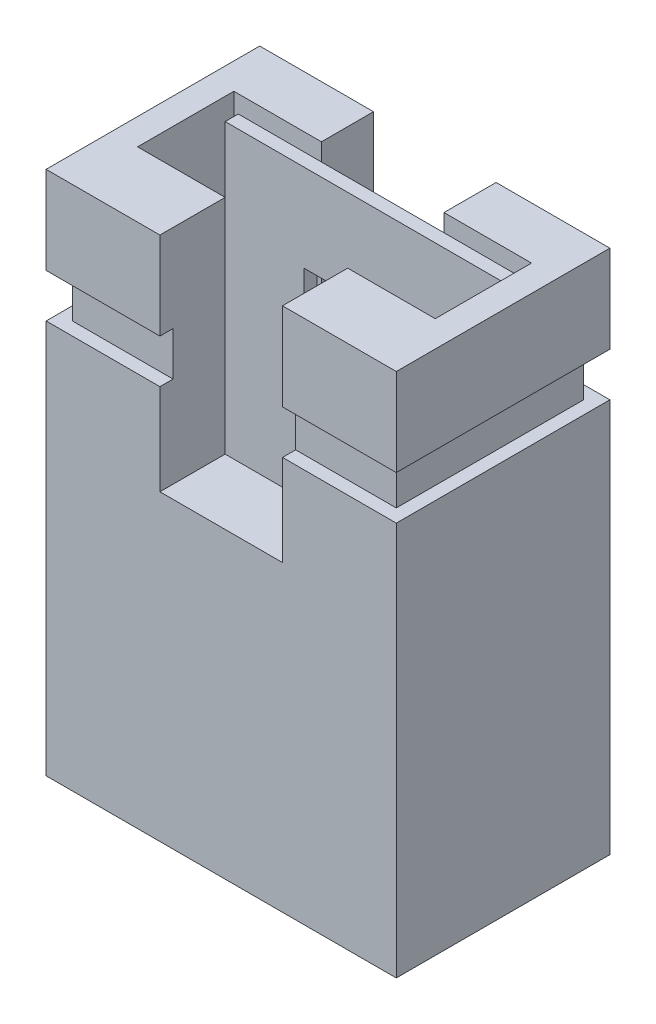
ISO-10303-21;
HEADER;
FILE_DESCRIPTION(('STEP AP214'),'2;1');
FILE_NAME('part.step','',(''),(''),'','','');
FILE_SCHEMA(('AUTOMOTIVE_DESIGN { 1 0 10303 214 1 1 1 1 }'));
ENDSEC;
DATA;
#1=APPLICATION_CONTEXT('core data for automotive mechanical design processes');
#2=APPLICATION_PROTOCOL_DEFINITION('international standard','automotive_design',2000,#1);
#3=PRODUCT_CONTEXT('',#1,'mechanical');
#4=PRODUCT('Part','Part','',(#3));
#5=PRODUCT_RELATED_PRODUCT_CATEGORY('part','',(#4));
#6=PRODUCT_DEFINITION_FORMATION('','',#4);
#7=PRODUCT_DEFINITION_CONTEXT('part definition',#1,'design');
#8=PRODUCT_DEFINITION('design','',#6,#7);
#9=PRODUCT_DEFINITION_SHAPE('','',#8);
#10=(LENGTH_UNIT() NAMED_UNIT(*) SI_UNIT(.MILLI.,.METRE.));
#11=(NAMED_UNIT(*) PLANE_ANGLE_UNIT() SI_UNIT($,.RADIAN.));
#12=(NAMED_UNIT(*) SI_UNIT($,.STERADIAN.) SOLID_ANGLE_UNIT());
#13=UNCERTAINTY_MEASURE_WITH_UNIT(LENGTH_MEASURE(1.E-05),#10,'distance_accuracy_value','');
#14=(GEOMETRIC_REPRESENTATION_CONTEXT(3) GLOBAL_UNCERTAINTY_ASSIGNED_CONTEXT((#13)) GLOBAL_UNIT_ASSIGNED_CONTEXT((#10,
#11,#12)) REPRESENTATION_CONTEXT('',''));
#15=CARTESIAN_POINT('',(0.,0.,0.));
#16=DIRECTION('',(0.,0.,1.));
#17=DIRECTION('',(1.,0.,0.));
#18=AXIS2_PLACEMENT_3D('',#15,#16,#17);
#19=CARTESIAN_POINT('',(-1.7,6.,-0.625));
#20=DIRECTION('',(0.,0.,1.));
#21=DIRECTION('',(1.,0.,0.));
#22=AXIS2_PLACEMENT_3D('',#19,#20,#21);
#23=PLANE('',#22);
#24=DIRECTION('',(0.,-1.,0.));
#25=VECTOR('',#24,1.);
#26=CARTESIAN_POINT('',(0.7,6.,-0.625));
#27=LINE('',#26,#25);
#28=CARTESIAN_POINT('',(0.7,6.,-0.625));
#29=VERTEX_POINT('',#28);
#30=CARTESIAN_POINT('',(0.7,5.8,-0.625));
#31=VERTEX_POINT('',#30);
#32=EDGE_CURVE('E415',#29,#31,#27,.T.);
#33=ORIENTED_EDGE('',*,*,#32,.T.);
#34=DIRECTION('',(-1.,0.,0.));
#35=VECTOR('',#34,1.);
#36=CARTESIAN_POINT('',(-1.65,5.8,-0.625));
#37=LINE('',#36,#35);
#38=CARTESIAN_POINT('',(1.65,5.8,-0.625));
#39=VERTEX_POINT('',#38);
#40=EDGE_CURVE('E45',#39,#31,#37,.T.);
#41=ORIENTED_EDGE('',*,*,#40,.F.);
#42=DIRECTION('',(0.,1.,0.));
#43=VECTOR('',#42,1.);
#44=CARTESIAN_POINT('',(1.65,0.4,-0.625));
#45=LINE('',#44,#43);
#46=CARTESIAN_POINT('',(1.65,0.4,-0.625));
#47=VERTEX_POINT('',#46);
#48=EDGE_CURVE('E49',#47,#39,#45,.T.);
#49=ORIENTED_EDGE('',*,*,#48,.F.);
#50=DIRECTION('',(1.,0.,0.));
#51=VECTOR('',#50,1.);
#52=CARTESIAN_POINT('',(-1.65,0.4,-0.625));
#53=LINE('',#52,#51);
#54=CARTESIAN_POINT('',(-1.65,0.399999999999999,-0.625));
#55=VERTEX_POINT('',#54);
#56=EDGE_CURVE('E317',#55,#47,#53,.T.);
#57=ORIENTED_EDGE('',*,*,#56,.F.);
#58=DIRECTION('',(0.,-1.,0.));
#59=VECTOR('',#58,1.);
#60=CARTESIAN_POINT('',(-1.65,0.4,-0.625));
#61=LINE('',#60,#59);
#62=CARTESIAN_POINT('',(-1.65,5.8,-0.625));
#63=VERTEX_POINT('',#62);
#64=EDGE_CURVE('E345',#63,#55,#61,.T.);
#65=ORIENTED_EDGE('',*,*,#64,.F.);
#66=DIRECTION('',(1.,0.,0.));
#67=VECTOR('',#66,1.);
#68=CARTESIAN_POINT('',(-1.7,5.8,-0.625));
#69=LINE('',#68,#67);
#70=CARTESIAN_POINT('',(-0.7,5.8,-0.625));
#71=VERTEX_POINT('',#70);
#72=EDGE_CURVE('E11',#63,#71,#69,.T.);
#73=ORIENTED_EDGE('',*,*,#72,.T.);
#74=DIRECTION('',(0.,1.,0.));
#75=VECTOR('',#74,1.);
#76=CARTESIAN_POINT('',(-0.7,6.,-0.625));
#77=LINE('',#76,#75);
#78=CARTESIAN_POINT('',(-0.7,6.,-0.625));
#79=VERTEX_POINT('',#78);
#80=EDGE_CURVE('E407',#71,#79,#77,.T.);
#81=ORIENTED_EDGE('',*,*,#80,.T.);
#82=DIRECTION('',(-1.,0.,0.));
#83=VECTOR('',#82,1.);
#84=CARTESIAN_POINT('',(-2.,6.,-0.625));
#85=LINE('',#84,#83);
#86=CARTESIAN_POINT('',(-1.7,6.,-0.625));
#87=VERTEX_POINT('',#86);
#88=EDGE_CURVE('E598',#79,#87,#85,.T.);
#89=ORIENTED_EDGE('',*,*,#88,.T.);
#90=DIRECTION('',(0.,-1.,0.));
#91=VECTOR('',#90,1.);
#92=CARTESIAN_POINT('',(-1.7,6.,-0.625));
#93=LINE('',#92,#91);
#94=CARTESIAN_POINT('',(-1.7,0.,-0.625));
#95=VERTEX_POINT('',#94);
#96=EDGE_CURVE('E396',#87,#95,#93,.T.);
#97=ORIENTED_EDGE('',*,*,#96,.T.);
#98=DIRECTION('',(-1.,0.,0.));
#99=VECTOR('',#98,1.);
#100=CARTESIAN_POINT('',(-1.7,0.,-0.625));
#101=LINE('',#100,#99);
#102=CARTESIAN_POINT('',(1.7,0.,-0.625));
#103=VERTEX_POINT('',#102);
#104=EDGE_CURVE('E384',#103,#95,#101,.T.);
#105=ORIENTED_EDGE('',*,*,#104,.F.);
#106=DIRECTION('',(0.,-1.,0.));
#107=VECTOR('',#106,1.);
#108=CARTESIAN_POINT('',(1.7,6.,-0.625));
#109=LINE('',#108,#107);
#110=CARTESIAN_POINT('',(1.7,6.,-0.625));
#111=VERTEX_POINT('',#110);
#112=EDGE_CURVE('E398',#111,#103,#109,.T.);
#113=ORIENTED_EDGE('',*,*,#112,.F.);
#114=DIRECTION('',(-1.,0.,0.));
#115=VECTOR('',#114,1.);
#116=CARTESIAN_POINT('',(-1.7,6.,-0.625));
#117=LINE('',#116,#115);
#118=EDGE_CURVE('E372',#111,#29,#117,.T.);
#119=ORIENTED_EDGE('',*,*,#118,.T.);
#120=EDGE_LOOP('',(#33,#41,#49,#57,#65,#73,#81,#89,#97,#105,#113,#119));
#121=FACE_BOUND('',#120,.T.);
#122=ADVANCED_FACE('F30',(#121),#23,.T.);
#123=CARTESIAN_POINT('',(-2.,0.,1.22));
#124=DIRECTION('',(0.,1.,0.));
#125=DIRECTION('',(0.,0.,1.));
#126=AXIS2_PLACEMENT_3D('',#123,#124,#125);
#127=PLANE('',#126);
#128=DIRECTION('',(1.,0.,0.));
#129=VECTOR('',#128,1.);
#130=CARTESIAN_POINT('',(-2.,0.,-1.22));
#131=LINE('',#130,#129);
#132=CARTESIAN_POINT('',(-2.,0.,-1.22));
#133=VERTEX_POINT('',#132);
#134=CARTESIAN_POINT('',(2.,0.,-1.22));
#135=VERTEX_POINT('',#134);
#136=EDGE_CURVE('E516',#133,#135,#131,.T.);
#137=ORIENTED_EDGE('',*,*,#136,.T.);
#138=DIRECTION('',(0.,0.,-1.));
#139=VECTOR('',#138,1.);
#140=CARTESIAN_POINT('',(2.,0.,1.22));
#141=LINE('',#140,#139);
#142=CARTESIAN_POINT('',(2.,0.,1.22));
#143=VERTEX_POINT('',#142);
#144=EDGE_CURVE('E592',#143,#135,#141,.T.);
#145=ORIENTED_EDGE('',*,*,#144,.F.);
#146=DIRECTION('',(1.,0.,0.));
#147=VECTOR('',#146,1.);
#148=CARTESIAN_POINT('',(-2.,0.,1.22));
#149=LINE('',#148,#147);
#150=CARTESIAN_POINT('',(-2.,0.,1.22));
#151=VERTEX_POINT('',#150);
#152=EDGE_CURVE('E482',#151,#143,#149,.T.);
#153=ORIENTED_EDGE('',*,*,#152,.F.);
#154=DIRECTION('',(0.,0.,-1.));
#155=VECTOR('',#154,1.);
#156=CARTESIAN_POINT('',(-2.,0.,1.22));
#157=LINE('',#156,#155);
#158=EDGE_CURVE('E595',#151,#133,#157,.T.);
#159=ORIENTED_EDGE('',*,*,#158,.T.);
#160=EDGE_LOOP('',(#137,#145,#153,#159));
#161=FACE_BOUND('',#160,.T.);
#162=DIRECTION('',(0.,0.,-1.));
#163=VECTOR('',#162,1.);
#164=CARTESIAN_POINT('',(1.7,0.,0.475));
#165=LINE('',#164,#163);
#166=CARTESIAN_POINT('',(1.7,0.,0.475));
#167=VERTEX_POINT('',#166);
#168=EDGE_CURVE('E369',#167,#103,#165,.T.);
#169=ORIENTED_EDGE('',*,*,#168,.T.);
#170=ORIENTED_EDGE('',*,*,#104,.T.);
#171=DIRECTION('',(0.,0.,1.));
#172=VECTOR('',#171,1.);
#173=CARTESIAN_POINT('',(-1.7,0.,0.475));
#174=LINE('',#173,#172);
#175=CARTESIAN_POINT('',(-1.7,0.,0.475));
#176=VERTEX_POINT('',#175);
#177=EDGE_CURVE('E387',#95,#176,#174,.T.);
#178=ORIENTED_EDGE('',*,*,#177,.T.);
#179=DIRECTION('',(1.,0.,0.));
#180=VECTOR('',#179,1.);
#181=CARTESIAN_POINT('',(-1.7,0.,0.475));
#182=LINE('',#181,#180);
#183=EDGE_CURVE('E373',#176,#167,#182,.T.);
#184=ORIENTED_EDGE('',*,*,#183,.T.);
#185=EDGE_LOOP('',(#169,#170,#178,#184));
#186=FACE_BOUND('',#185,.T.);
#187=ADVANCED_FACE('F693',(#161,#186),#127,.F.);
#188=CARTESIAN_POINT('',(0.7,6.,1.22));
#189=DIRECTION('',(0.,-1.,0.));
#190=DIRECTION('',(0.,0.,-1.));
#191=AXIS2_PLACEMENT_3D('',#188,#189,#190);
#192=PLANE('',#191);
#193=ORIENTED_EDGE('',*,*,#118,.F.);
#194=DIRECTION('',(0.,0.,-1.));
#195=VECTOR('',#194,1.);
#196=CARTESIAN_POINT('',(1.7,6.,0.475));
#197=LINE('',#196,#195);
#198=CARTESIAN_POINT('',(1.7,6.,0.475));
#199=VERTEX_POINT('',#198);
#200=EDGE_CURVE('E370',#199,#111,#197,.T.);
#201=ORIENTED_EDGE('',*,*,#200,.F.);
#202=DIRECTION('',(1.,0.,0.));
#203=VECTOR('',#202,1.);
#204=CARTESIAN_POINT('',(-1.7,6.,0.475));
#205=LINE('',#204,#203);
#206=CARTESIAN_POINT('',(0.7,6.,0.475));
#207=VERTEX_POINT('',#206);
#208=EDGE_CURVE('E378',#207,#199,#205,.T.);
#209=ORIENTED_EDGE('',*,*,#208,.F.);
#210=DIRECTION('',(0.,0.,-1.));
#211=VECTOR('',#210,1.);
#212=CARTESIAN_POINT('',(0.7,6.,1.22));
#213=LINE('',#212,#211);
#214=CARTESIAN_POINT('',(0.7,6.,1.22));
#215=VERTEX_POINT('',#214);
#216=EDGE_CURVE('E574',#215,#207,#213,.T.);
#217=ORIENTED_EDGE('',*,*,#216,.F.);
#218=DIRECTION('',(-1.,0.,0.));
#219=VECTOR('',#218,1.);
#220=CARTESIAN_POINT('',(0.7,6.,1.22));
#221=LINE('',#220,#219);
#222=CARTESIAN_POINT('',(2.,6.,1.22));
#223=VERTEX_POINT('',#222);
#224=EDGE_CURVE('E493',#223,#215,#221,.T.);
#225=ORIENTED_EDGE('',*,*,#224,.F.);
#226=DIRECTION('',(0.,0.,-1.));
#227=VECTOR('',#226,1.);
#228=CARTESIAN_POINT('',(2.,6.,1.22));
#229=LINE('',#228,#227);
#230=CARTESIAN_POINT('',(2.,6.,-1.22));
#231=VERTEX_POINT('',#230);
#232=EDGE_CURVE('E577',#223,#231,#229,.T.);
#233=ORIENTED_EDGE('',*,*,#232,.T.);
#234=DIRECTION('',(-1.,0.,0.));
#235=VECTOR('',#234,1.);
#236=CARTESIAN_POINT('',(0.7,6.,-1.22));
#237=LINE('',#236,#235);
#238=CARTESIAN_POINT('',(0.7,6.,-1.22));
#239=VERTEX_POINT('',#238);
#240=EDGE_CURVE('E526',#231,#239,#237,.T.);
#241=ORIENTED_EDGE('',*,*,#240,.T.);
#242=EDGE_CURVE('E573',#29,#239,#213,.T.);
#243=ORIENTED_EDGE('',*,*,#242,.F.);
#244=EDGE_LOOP('',(#193,#201,#209,#217,#225,#233,#241,#243));
#245=FACE_BOUND('',#244,.T.);
#246=ADVANCED_FACE('F685',(#245),#192,.F.);
#247=CARTESIAN_POINT('',(0.7,6.,1.22));
#248=DIRECTION('',(1.,0.,0.));
#249=DIRECTION('',(0.,1.,0.));
#250=AXIS2_PLACEMENT_3D('',#247,#248,#249);
#251=PLANE('',#250);
#252=ORIENTED_EDGE('',*,*,#32,.F.);
#253=ORIENTED_EDGE('',*,*,#242,.T.);
#254=DIRECTION('',(0.,-1.,0.));
#255=VECTOR('',#254,1.);
#256=CARTESIAN_POINT('',(0.7,6.,-1.22));
#257=LINE('',#256,#255);
#258=CARTESIAN_POINT('',(0.7,5.,-1.22));
#259=VERTEX_POINT('',#258);
#260=EDGE_CURVE('E530',#239,#259,#257,.T.);
#261=ORIENTED_EDGE('',*,*,#260,.T.);
#262=DIRECTION('',(0.,0.,1.));
#263=VECTOR('',#262,1.);
#264=CARTESIAN_POINT('',(0.7,5.00000000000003,1.22000000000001));
#265=LINE('',#264,#263);
#266=CARTESIAN_POINT('',(0.7,5.,-1.07));
#267=VERTEX_POINT('',#266);
#268=EDGE_CURVE('E430',#259,#267,#265,.T.);
#269=ORIENTED_EDGE('',*,*,#268,.T.);
#270=DIRECTION('',(0.,-1.,0.));
#271=VECTOR('',#270,1.);
#272=CARTESIAN_POINT('',(0.7,6.,-1.07));
#273=LINE('',#272,#271);
#274=CARTESIAN_POINT('',(0.7,4.5,-1.07));
#275=VERTEX_POINT('',#274);
#276=EDGE_CURVE('E445',#267,#275,#273,.T.);
#277=ORIENTED_EDGE('',*,*,#276,.T.);
#278=DIRECTION('',(0.,0.,-1.));
#279=VECTOR('',#278,1.);
#280=CARTESIAN_POINT('',(0.7,4.50000000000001,1.22000000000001));
#281=LINE('',#280,#279);
#282=CARTESIAN_POINT('',(0.7,4.5,-1.22));
#283=VERTEX_POINT('',#282);
#284=EDGE_CURVE('E436',#275,#283,#281,.T.);
#285=ORIENTED_EDGE('',*,*,#284,.T.);
#286=CARTESIAN_POINT('',(0.7,3.46,-1.22));
#287=VERTEX_POINT('',#286);
#288=EDGE_CURVE('E529',#283,#287,#257,.T.);
#289=ORIENTED_EDGE('',*,*,#288,.T.);
#290=DIRECTION('',(0.,0.,-1.));
#291=VECTOR('',#290,1.);
#292=CARTESIAN_POINT('',(0.7,3.46,1.22));
#293=LINE('',#292,#291);
#294=CARTESIAN_POINT('',(0.7,3.46,-0.625));
#295=VERTEX_POINT('',#294);
#296=EDGE_CURVE('E569',#295,#287,#293,.T.);
#297=ORIENTED_EDGE('',*,*,#296,.F.);
#298=CARTESIAN_POINT('',(0.7,4.8,-0.625));
#299=VERTEX_POINT('',#298);
#300=EDGE_CURVE('E414',#299,#295,#27,.T.);
#301=ORIENTED_EDGE('',*,*,#300,.F.);
#302=EDGE_CURVE('E418',#31,#299,#27,.T.);
#303=ORIENTED_EDGE('',*,*,#302,.F.);
#304=EDGE_LOOP('',(#252,#253,#261,#269,#277,#285,#289,#297,#301,#303));
#305=FACE_BOUND('',#304,.T.);
#306=ADVANCED_FACE('F623',(#305),#251,.F.);
#307=DIRECTION('',(0.,1.,0.));
#308=VECTOR('',#307,1.);
#309=CARTESIAN_POINT('',(0.7,6.,0.475));
#310=LINE('',#309,#308);
#311=CARTESIAN_POINT('',(0.7,3.46,0.475));
#312=VERTEX_POINT('',#311);
#313=EDGE_CURVE('E405',#312,#207,#310,.T.);
#314=ORIENTED_EDGE('',*,*,#313,.F.);
#315=CARTESIAN_POINT('',(0.7,3.46,1.22));
#316=VERTEX_POINT('',#315);
#317=EDGE_CURVE('E570',#316,#312,#293,.T.);
#318=ORIENTED_EDGE('',*,*,#317,.F.);
#319=DIRECTION('',(0.,-1.,0.));
#320=VECTOR('',#319,1.);
#321=CARTESIAN_POINT('',(0.7,6.,1.22));
#322=LINE('',#321,#320);
#323=CARTESIAN_POINT('',(0.7,4.5,1.22));
#324=VERTEX_POINT('',#323);
#325=EDGE_CURVE('E495',#324,#316,#322,.T.);
#326=ORIENTED_EDGE('',*,*,#325,.F.);
#327=DIRECTION('',(0.,0.,-1.));
#328=VECTOR('',#327,1.);
#329=CARTESIAN_POINT('',(0.7,4.5,1.22));
#330=LINE('',#329,#328);
#331=CARTESIAN_POINT('',(0.7,4.5,1.07));
#332=VERTEX_POINT('',#331);
#333=EDGE_CURVE('E460',#324,#332,#330,.T.);
#334=ORIENTED_EDGE('',*,*,#333,.T.);
#335=DIRECTION('',(0.,1.,0.));
#336=VECTOR('',#335,1.);
#337=CARTESIAN_POINT('',(0.7,6.,1.07));
#338=LINE('',#337,#336);
#339=CARTESIAN_POINT('',(0.7,5.,1.07));
#340=VERTEX_POINT('',#339);
#341=EDGE_CURVE('E475',#332,#340,#338,.T.);
#342=ORIENTED_EDGE('',*,*,#341,.T.);
#343=DIRECTION('',(0.,0.,1.));
#344=VECTOR('',#343,1.);
#345=CARTESIAN_POINT('',(0.7,5.,1.22));
#346=LINE('',#345,#344);
#347=CARTESIAN_POINT('',(0.7,5.,1.22));
#348=VERTEX_POINT('',#347);
#349=EDGE_CURVE('E466',#340,#348,#346,.T.);
#350=ORIENTED_EDGE('',*,*,#349,.T.);
#351=EDGE_CURVE('E496',#215,#348,#322,.T.);
#352=ORIENTED_EDGE('',*,*,#351,.F.);
#353=ORIENTED_EDGE('',*,*,#216,.T.);
#354=EDGE_LOOP('',(#314,#318,#326,#334,#342,#350,#352,#353));
#355=FACE_BOUND('',#354,.T.);
#356=ADVANCED_FACE('F677',(#355),#251,.F.);
#357=CARTESIAN_POINT('',(-0.7,3.46,1.22));
#358=DIRECTION('',(0.,-1.,0.));
#359=DIRECTION('',(0.,0.,-1.));
#360=AXIS2_PLACEMENT_3D('',#357,#358,#359);
#361=PLANE('',#360);
#362=DIRECTION('',(-1.,0.,0.));
#363=VECTOR('',#362,1.);
#364=CARTESIAN_POINT('',(-0.7,3.46,-0.625));
#365=LINE('',#364,#363);
#366=CARTESIAN_POINT('',(-0.7,3.46,-0.625));
#367=VERTEX_POINT('',#366);
#368=EDGE_CURVE('E411',#295,#367,#365,.T.);
#369=ORIENTED_EDGE('',*,*,#368,.F.);
#370=ORIENTED_EDGE('',*,*,#296,.T.);
#371=DIRECTION('',(-1.,0.,0.));
#372=VECTOR('',#371,1.);
#373=CARTESIAN_POINT('',(-0.7,3.46,-1.22));
#374=LINE('',#373,#372);
#375=CARTESIAN_POINT('',(-0.7,3.46,-1.22));
#376=VERTEX_POINT('',#375);
#377=EDGE_CURVE('E533',#287,#376,#374,.T.);
#378=ORIENTED_EDGE('',*,*,#377,.T.);
#379=DIRECTION('',(0.,0.,-1.));
#380=VECTOR('',#379,1.);
#381=CARTESIAN_POINT('',(-0.7,3.46,1.22));
#382=LINE('',#381,#380);
#383=EDGE_CURVE('E565',#367,#376,#382,.T.);
#384=ORIENTED_EDGE('',*,*,#383,.F.);
#385=EDGE_LOOP('',(#369,#370,#378,#384));
#386=FACE_BOUND('',#385,.T.);
#387=ADVANCED_FACE('F621',(#386),#361,.F.);
#388=DIRECTION('',(1.,0.,0.));
#389=VECTOR('',#388,1.);
#390=CARTESIAN_POINT('',(-0.7,3.46,0.475));
#391=LINE('',#390,#389);
#392=CARTESIAN_POINT('',(-0.7,3.46,0.475));
#393=VERTEX_POINT('',#392);
#394=EDGE_CURVE('E403',#393,#312,#391,.T.);
#395=ORIENTED_EDGE('',*,*,#394,.F.);
#396=CARTESIAN_POINT('',(-0.7,3.46,1.22));
#397=VERTEX_POINT('',#396);
#398=EDGE_CURVE('E566',#397,#393,#382,.T.);
#399=ORIENTED_EDGE('',*,*,#398,.F.);
#400=DIRECTION('',(-1.,0.,0.));
#401=VECTOR('',#400,1.);
#402=CARTESIAN_POINT('',(-0.7,3.46,1.22));
#403=LINE('',#402,#401);
#404=EDGE_CURVE('E499',#316,#397,#403,.T.);
#405=ORIENTED_EDGE('',*,*,#404,.F.);
#406=ORIENTED_EDGE('',*,*,#317,.T.);
#407=EDGE_LOOP('',(#395,#399,#405,#406));
#408=FACE_BOUND('',#407,.T.);
#409=ADVANCED_FACE('F672',(#408),#361,.F.);
#410=CARTESIAN_POINT('',(-0.7,6.,1.22));
#411=DIRECTION('',(-1.,0.,0.));
#412=DIRECTION('',(0.,-1.,0.));
#413=AXIS2_PLACEMENT_3D('',#410,#411,#412);
#414=PLANE('',#413);
#415=CARTESIAN_POINT('',(-0.7,4.8,-0.625));
#416=VERTEX_POINT('',#415);
#417=EDGE_CURVE('E408',#367,#416,#77,.T.);
#418=ORIENTED_EDGE('',*,*,#417,.F.);
#419=ORIENTED_EDGE('',*,*,#383,.T.);
#420=DIRECTION('',(0.,1.,0.));
#421=VECTOR('',#420,1.);
#422=CARTESIAN_POINT('',(-0.7,6.,-1.22));
#423=LINE('',#422,#421);
#424=CARTESIAN_POINT('',(-0.7,4.5,-1.22));
#425=VERTEX_POINT('',#424);
#426=EDGE_CURVE('E537',#376,#425,#423,.T.);
#427=ORIENTED_EDGE('',*,*,#426,.T.);
#428=DIRECTION('',(0.,0.,1.));
#429=VECTOR('',#428,1.);
#430=CARTESIAN_POINT('',(-0.7,4.50000000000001,1.22000000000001));
#431=LINE('',#430,#429);
#432=CARTESIAN_POINT('',(-0.7,4.5,-1.07));
#433=VERTEX_POINT('',#432);
#434=EDGE_CURVE('E433',#425,#433,#431,.T.);
#435=ORIENTED_EDGE('',*,*,#434,.T.);
#436=DIRECTION('',(0.,1.,0.));
#437=VECTOR('',#436,1.);
#438=CARTESIAN_POINT('',(-0.7,6.,-1.07));
#439=LINE('',#438,#437);
#440=CARTESIAN_POINT('',(-0.7,5.,-1.07));
#441=VERTEX_POINT('',#440);
#442=EDGE_CURVE('E442',#433,#441,#439,.T.);
#443=ORIENTED_EDGE('',*,*,#442,.T.);
#444=DIRECTION('',(0.,0.,-1.));
#445=VECTOR('',#444,1.);
#446=CARTESIAN_POINT('',(-0.7,5.00000000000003,1.22000000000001));
#447=LINE('',#446,#445);
#448=CARTESIAN_POINT('',(-0.7,5.,-1.22));
#449=VERTEX_POINT('',#448);
#450=EDGE_CURVE('E427',#441,#449,#447,.T.);
#451=ORIENTED_EDGE('',*,*,#450,.T.);
#452=CARTESIAN_POINT('',(-0.7,6.,-1.22));
#453=VERTEX_POINT('',#452);
#454=EDGE_CURVE('E536',#449,#453,#423,.T.);
#455=ORIENTED_EDGE('',*,*,#454,.T.);
#456=DIRECTION('',(0.,0.,-1.));
#457=VECTOR('',#456,1.);
#458=CARTESIAN_POINT('',(-0.7,6.,1.22));
#459=LINE('',#458,#457);
#460=EDGE_CURVE('E561',#79,#453,#459,.T.);
#461=ORIENTED_EDGE('',*,*,#460,.F.);
#462=ORIENTED_EDGE('',*,*,#80,.F.);
#463=EDGE_CURVE('E412',#416,#71,#77,.T.);
#464=ORIENTED_EDGE('',*,*,#463,.F.);
#465=EDGE_LOOP('',(#418,#419,#427,#435,#443,#451,#455,#461,#462,#464));
#466=FACE_BOUND('',#465,.T.);
#467=ADVANCED_FACE('F633',(#466),#414,.F.);
#468=DIRECTION('',(0.,-1.,0.));
#469=VECTOR('',#468,1.);
#470=CARTESIAN_POINT('',(-0.7,6.,0.475));
#471=LINE('',#470,#469);
#472=CARTESIAN_POINT('',(-0.7,6.,0.475));
#473=VERTEX_POINT('',#472);
#474=EDGE_CURVE('E401',#473,#393,#471,.T.);
#475=ORIENTED_EDGE('',*,*,#474,.F.);
#476=CARTESIAN_POINT('',(-0.7,6.,1.22));
#477=VERTEX_POINT('',#476);
#478=EDGE_CURVE('E562',#477,#473,#459,.T.);
#479=ORIENTED_EDGE('',*,*,#478,.F.);
#480=DIRECTION('',(0.,1.,0.));
#481=VECTOR('',#480,1.);
#482=CARTESIAN_POINT('',(-0.7,6.,1.22));
#483=LINE('',#482,#481);
#484=CARTESIAN_POINT('',(-0.7,5.,1.22));
#485=VERTEX_POINT('',#484);
#486=EDGE_CURVE('E501',#485,#477,#483,.T.);
#487=ORIENTED_EDGE('',*,*,#486,.F.);
#488=DIRECTION('',(0.,0.,-1.));
#489=VECTOR('',#488,1.);
#490=CARTESIAN_POINT('',(-0.7,5.,1.22));
#491=LINE('',#490,#489);
#492=CARTESIAN_POINT('',(-0.7,5.,1.07));
#493=VERTEX_POINT('',#492);
#494=EDGE_CURVE('E463',#485,#493,#491,.T.);
#495=ORIENTED_EDGE('',*,*,#494,.T.);
#496=DIRECTION('',(0.,-1.,0.));
#497=VECTOR('',#496,1.);
#498=CARTESIAN_POINT('',(-0.7,6.,1.07));
#499=LINE('',#498,#497);
#500=CARTESIAN_POINT('',(-0.7,4.5,1.07));
#501=VERTEX_POINT('',#500);
#502=EDGE_CURVE('E472',#493,#501,#499,.T.);
#503=ORIENTED_EDGE('',*,*,#502,.T.);
#504=DIRECTION('',(0.,0.,1.));
#505=VECTOR('',#504,1.);
#506=CARTESIAN_POINT('',(-0.7,4.5,1.22));
#507=LINE('',#506,#505);
#508=CARTESIAN_POINT('',(-0.7,4.5,1.22));
#509=VERTEX_POINT('',#508);
#510=EDGE_CURVE('E457',#501,#509,#507,.T.);
#511=ORIENTED_EDGE('',*,*,#510,.T.);
#512=EDGE_CURVE('E502',#397,#509,#483,.T.);
#513=ORIENTED_EDGE('',*,*,#512,.F.);
#514=ORIENTED_EDGE('',*,*,#398,.T.);
#515=EDGE_LOOP('',(#475,#479,#487,#495,#503,#511,#513,#514));
#516=FACE_BOUND('',#515,.T.);
#517=ADVANCED_FACE('F664',(#516),#414,.F.);
#518=CARTESIAN_POINT('',(-2.,6.,1.22));
#519=DIRECTION('',(0.,-1.,0.));
#520=DIRECTION('',(0.,0.,-1.));
#521=AXIS2_PLACEMENT_3D('',#518,#519,#520);
#522=PLANE('',#521);
#523=ORIENTED_EDGE('',*,*,#88,.F.);
#524=ORIENTED_EDGE('',*,*,#460,.T.);
#525=DIRECTION('',(-1.,0.,0.));
#526=VECTOR('',#525,1.);
#527=CARTESIAN_POINT('',(-2.,6.,-1.22));
#528=LINE('',#527,#526);
#529=CARTESIAN_POINT('',(-2.,6.,-1.22));
#530=VERTEX_POINT('',#529);
#531=EDGE_CURVE('E540',#453,#530,#528,.T.);
#532=ORIENTED_EDGE('',*,*,#531,.T.);
#533=DIRECTION('',(0.,0.,-1.));
#534=VECTOR('',#533,1.);
#535=CARTESIAN_POINT('',(-2.,6.,1.22));
#536=LINE('',#535,#534);
#537=CARTESIAN_POINT('',(-2.,6.,1.22));
#538=VERTEX_POINT('',#537);
#539=EDGE_CURVE('E558',#538,#530,#536,.T.);
#540=ORIENTED_EDGE('',*,*,#539,.F.);
#541=DIRECTION('',(-1.,0.,0.));
#542=VECTOR('',#541,1.);
#543=CARTESIAN_POINT('',(-2.,6.,1.22));
#544=LINE('',#543,#542);
#545=EDGE_CURVE('E505',#477,#538,#544,.T.);
#546=ORIENTED_EDGE('',*,*,#545,.F.);
#547=ORIENTED_EDGE('',*,*,#478,.T.);
#548=CARTESIAN_POINT('',(-1.7,6.,0.475));
#549=VERTEX_POINT('',#548);
#550=EDGE_CURVE('E379',#549,#473,#205,.T.);
#551=ORIENTED_EDGE('',*,*,#550,.F.);
#552=DIRECTION('',(0.,0.,1.));
#553=VECTOR('',#552,1.);
#554=CARTESIAN_POINT('',(-1.7,6.,0.475));
#555=LINE('',#554,#553);
#556=EDGE_CURVE('E375',#87,#549,#555,.T.);
#557=ORIENTED_EDGE('',*,*,#556,.F.);
#558=EDGE_LOOP('',(#523,#524,#532,#540,#546,#547,#551,#557));
#559=FACE_BOUND('',#558,.T.);
#560=ADVANCED_FACE('F641',(#559),#522,.F.);
#561=CARTESIAN_POINT('',(-2.,4.5,-1.22));
#562=DIRECTION('',(0.,0.,-1.));
#563=DIRECTION('',(-1.,0.,0.));
#564=AXIS2_PLACEMENT_3D('',#561,#562,#563);
#565=PLANE('',#564);
#566=ORIENTED_EDGE('',*,*,#288,.F.);
#567=DIRECTION('',(-1.,0.,0.));
#568=VECTOR('',#567,1.);
#569=CARTESIAN_POINT('',(2.,4.5,-1.22));
#570=LINE('',#569,#568);
#571=CARTESIAN_POINT('',(2.,4.5,-1.22));
#572=VERTEX_POINT('',#571);
#573=EDGE_CURVE('E520',#572,#283,#570,.T.);
#574=ORIENTED_EDGE('',*,*,#573,.F.);
#575=DIRECTION('',(0.,1.,0.));
#576=VECTOR('',#575,1.);
#577=CARTESIAN_POINT('',(2.,0.,-1.22));
#578=LINE('',#577,#576);
#579=EDGE_CURVE('E518',#135,#572,#578,.T.);
#580=ORIENTED_EDGE('',*,*,#579,.F.);
#581=ORIENTED_EDGE('',*,*,#136,.F.);
#582=DIRECTION('',(0.,-1.,0.));
#583=VECTOR('',#582,1.);
#584=CARTESIAN_POINT('',(-2.,0.,-1.22));
#585=LINE('',#584,#583);
#586=CARTESIAN_POINT('',(-2.,4.5,-1.22));
#587=VERTEX_POINT('',#586);
#588=EDGE_CURVE('E478',#587,#133,#585,.T.);
#589=ORIENTED_EDGE('',*,*,#588,.F.);
#590=DIRECTION('',(-1.,0.,0.));
#591=VECTOR('',#590,1.);
#592=CARTESIAN_POINT('',(-2.,4.5,-1.22));
#593=LINE('',#592,#591);
#594=EDGE_CURVE('E483',#425,#587,#593,.T.);
#595=ORIENTED_EDGE('',*,*,#594,.F.);
#596=ORIENTED_EDGE('',*,*,#426,.F.);
#597=ORIENTED_EDGE('',*,*,#377,.F.);
#598=EDGE_LOOP('',(#566,#574,#580,#581,#589,#595,#596,#597));
#599=FACE_BOUND('',#598,.T.);
#600=ADVANCED_FACE('F629',(#599),#565,.T.);
#601=ORIENTED_EDGE('',*,*,#454,.F.);
#602=DIRECTION('',(1.,0.,0.));
#603=VECTOR('',#602,1.);
#604=CARTESIAN_POINT('',(-2.,5.,-1.22));
#605=LINE('',#604,#603);
#606=CARTESIAN_POINT('',(-2.,5.,-1.22));
#607=VERTEX_POINT('',#606);
#608=EDGE_CURVE('E545',#607,#449,#605,.T.);
#609=ORIENTED_EDGE('',*,*,#608,.F.);
#610=DIRECTION('',(0.,-1.,0.));
#611=VECTOR('',#610,1.);
#612=CARTESIAN_POINT('',(-2.,5.,-1.22));
#613=LINE('',#612,#611);
#614=EDGE_CURVE('E542',#530,#607,#613,.T.);
#615=ORIENTED_EDGE('',*,*,#614,.F.);
#616=ORIENTED_EDGE('',*,*,#531,.F.);
#617=EDGE_LOOP('',(#601,#609,#615,#616));
#618=FACE_BOUND('',#617,.T.);
#619=ADVANCED_FACE('F649',(#618),#565,.T.);
#620=CARTESIAN_POINT('',(-2.,4.5,1.22));
#621=DIRECTION('',(0.,0.,-1.));
#622=DIRECTION('',(-1.,0.,0.));
#623=AXIS2_PLACEMENT_3D('',#620,#621,#622);
#624=PLANE('',#623);
#625=ORIENTED_EDGE('',*,*,#351,.T.);
#626=DIRECTION('',(1.,0.,0.));
#627=VECTOR('',#626,1.);
#628=CARTESIAN_POINT('',(2.,5.,1.22));
#629=LINE('',#628,#627);
#630=CARTESIAN_POINT('',(2.,5.,1.22));
#631=VERTEX_POINT('',#630);
#632=EDGE_CURVE('E489',#348,#631,#629,.T.);
#633=ORIENTED_EDGE('',*,*,#632,.T.);
#634=DIRECTION('',(0.,1.,0.));
#635=VECTOR('',#634,1.);
#636=CARTESIAN_POINT('',(2.,5.,1.22));
#637=LINE('',#636,#635);
#638=EDGE_CURVE('E491',#631,#223,#637,.T.);
#639=ORIENTED_EDGE('',*,*,#638,.T.);
#640=ORIENTED_EDGE('',*,*,#224,.T.);
#641=EDGE_LOOP('',(#625,#633,#639,#640));
#642=FACE_BOUND('',#641,.T.);
#643=ADVANCED_FACE('F737',(#642),#624,.F.);
#644=DIRECTION('',(1.,0.,0.));
#645=VECTOR('',#644,1.);
#646=CARTESIAN_POINT('',(-2.,5.,1.22));
#647=LINE('',#646,#645);
#648=CARTESIAN_POINT('',(-2.,5.,1.22));
#649=VERTEX_POINT('',#648);
#650=EDGE_CURVE('E509',#649,#485,#647,.T.);
#651=ORIENTED_EDGE('',*,*,#650,.T.);
#652=ORIENTED_EDGE('',*,*,#486,.T.);
#653=ORIENTED_EDGE('',*,*,#545,.T.);
#654=DIRECTION('',(0.,-1.,0.));
#655=VECTOR('',#654,1.);
#656=CARTESIAN_POINT('',(-2.,5.,1.22));
#657=LINE('',#656,#655);
#658=EDGE_CURVE('E507',#538,#649,#657,.T.);
#659=ORIENTED_EDGE('',*,*,#658,.T.);
#660=EDGE_LOOP('',(#651,#652,#653,#659));
#661=FACE_BOUND('',#660,.T.);
#662=ADVANCED_FACE('F658',(#661),#624,.F.);
#663=CARTESIAN_POINT('',(-2.,0.,1.22));
#664=DIRECTION('',(1.,0.,0.));
#665=DIRECTION('',(0.,0.,-1.));
#666=AXIS2_PLACEMENT_3D('',#663,#664,#665);
#667=PLANE('',#666);
#668=ORIENTED_EDGE('',*,*,#588,.T.);
#669=ORIENTED_EDGE('',*,*,#158,.F.);
#670=DIRECTION('',(0.,-1.,0.));
#671=VECTOR('',#670,1.);
#672=CARTESIAN_POINT('',(-2.,0.,1.22));
#673=LINE('',#672,#671);
#674=CARTESIAN_POINT('',(-2.,4.5,1.22));
#675=VERTEX_POINT('',#674);
#676=EDGE_CURVE('E479',#675,#151,#673,.T.);
#677=ORIENTED_EDGE('',*,*,#676,.F.);
#678=DIRECTION('',(0.,0.,-1.));
#679=VECTOR('',#678,1.);
#680=CARTESIAN_POINT('',(-2.,4.5,1.22));
#681=LINE('',#680,#679);
#682=EDGE_CURVE('E513',#675,#587,#681,.T.);
#683=ORIENTED_EDGE('',*,*,#682,.T.);
#684=EDGE_LOOP('',(#668,#669,#677,#683));
#685=FACE_BOUND('',#684,.T.);
#686=ADVANCED_FACE('F32',(#685),#667,.F.);
#687=CARTESIAN_POINT('',(2.,0.,1.22));
#688=DIRECTION('',(-1.,0.,0.));
#689=DIRECTION('',(0.,0.,1.));
#690=AXIS2_PLACEMENT_3D('',#687,#688,#689);
#691=PLANE('',#690);
#692=ORIENTED_EDGE('',*,*,#579,.T.);
#693=DIRECTION('',(0.,0.,-1.));
#694=VECTOR('',#693,1.);
#695=CARTESIAN_POINT('',(2.,4.5,1.22));
#696=LINE('',#695,#694);
#697=CARTESIAN_POINT('',(2.,4.5,1.22));
#698=VERTEX_POINT('',#697);
#699=EDGE_CURVE('E589',#698,#572,#696,.T.);
#700=ORIENTED_EDGE('',*,*,#699,.F.);
#701=DIRECTION('',(0.,1.,0.));
#702=VECTOR('',#701,1.);
#703=CARTESIAN_POINT('',(2.,0.,1.22));
#704=LINE('',#703,#702);
#705=EDGE_CURVE('E485',#143,#698,#704,.T.);
#706=ORIENTED_EDGE('',*,*,#705,.F.);
#707=ORIENTED_EDGE('',*,*,#144,.T.);
#708=EDGE_LOOP('',(#692,#700,#706,#707));
#709=FACE_BOUND('',#708,.T.);
#710=ADVANCED_FACE('F779',(#709),#691,.F.);
#711=CARTESIAN_POINT('',(2.,4.5,1.22));
#712=DIRECTION('',(0.,-1.,0.));
#713=DIRECTION('',(0.,0.,-1.));
#714=AXIS2_PLACEMENT_3D('',#711,#712,#713);
#715=PLANE('',#714);
#716=ORIENTED_EDGE('',*,*,#573,.T.);
#717=ORIENTED_EDGE('',*,*,#284,.F.);
#718=DIRECTION('',(1.,0.,0.));
#719=VECTOR('',#718,1.);
#720=CARTESIAN_POINT('',(-2.,4.5,-1.07));
#721=LINE('',#720,#719);
#722=CARTESIAN_POINT('',(1.85,4.5,-1.07));
#723=VERTEX_POINT('',#722);
#724=EDGE_CURVE('E422',#275,#723,#721,.T.);
#725=ORIENTED_EDGE('',*,*,#724,.T.);
#726=DIRECTION('',(0.,0.,-1.));
#727=VECTOR('',#726,1.);
#728=CARTESIAN_POINT('',(1.85,4.5,1.22));
#729=LINE('',#728,#727);
#730=CARTESIAN_POINT('',(1.85,4.5,1.07));
#731=VERTEX_POINT('',#730);
#732=EDGE_CURVE('E586',#731,#723,#729,.T.);
#733=ORIENTED_EDGE('',*,*,#732,.F.);
#734=DIRECTION('',(1.,0.,0.));
#735=VECTOR('',#734,1.);
#736=CARTESIAN_POINT('',(-2.,4.5,1.07));
#737=LINE('',#736,#735);
#738=EDGE_CURVE('E451',#332,#731,#737,.T.);
#739=ORIENTED_EDGE('',*,*,#738,.F.);
#740=ORIENTED_EDGE('',*,*,#333,.F.);
#741=DIRECTION('',(-1.,0.,0.));
#742=VECTOR('',#741,1.);
#743=CARTESIAN_POINT('',(2.,4.5,1.22));
#744=LINE('',#743,#742);
#745=EDGE_CURVE('E487',#698,#324,#744,.T.);
#746=ORIENTED_EDGE('',*,*,#745,.F.);
#747=ORIENTED_EDGE('',*,*,#699,.T.);
#748=EDGE_LOOP('',(#716,#717,#725,#733,#739,#740,#746,#747));
#749=FACE_BOUND('',#748,.T.);
#750=ADVANCED_FACE('F775',(#749),#715,.F.);
#751=CARTESIAN_POINT('',(1.85,5.,1.22));
#752=DIRECTION('',(-1.,0.,0.));
#753=DIRECTION('',(0.,0.,1.));
#754=AXIS2_PLACEMENT_3D('',#751,#752,#753);
#755=PLANE('',#754);
#756=ORIENTED_EDGE('',*,*,#732,.T.);
#757=DIRECTION('',(0.,-1.,0.));
#758=VECTOR('',#757,1.);
#759=CARTESIAN_POINT('',(1.85,4.5,-1.07));
#760=LINE('',#759,#758);
#761=CARTESIAN_POINT('',(1.85,5.,-1.07));
#762=VERTEX_POINT('',#761);
#763=EDGE_CURVE('E417',#762,#723,#760,.T.);
#764=ORIENTED_EDGE('',*,*,#763,.F.);
#765=DIRECTION('',(0.,0.,-1.));
#766=VECTOR('',#765,1.);
#767=CARTESIAN_POINT('',(1.85,5.,1.22));
#768=LINE('',#767,#766);
#769=CARTESIAN_POINT('',(1.85,5.,1.07));
#770=VERTEX_POINT('',#769);
#771=EDGE_CURVE('E583',#770,#762,#768,.T.);
#772=ORIENTED_EDGE('',*,*,#771,.F.);
#773=DIRECTION('',(0.,1.,0.));
#774=VECTOR('',#773,1.);
#775=CARTESIAN_POINT('',(1.85,4.5,1.07));
#776=LINE('',#775,#774);
#777=EDGE_CURVE('E448',#731,#770,#776,.T.);
#778=ORIENTED_EDGE('',*,*,#777,.F.);
#779=EDGE_LOOP('',(#756,#764,#772,#778));
#780=FACE_BOUND('',#779,.T.);
#781=ADVANCED_FACE('F771',(#780),#755,.F.);
#782=CARTESIAN_POINT('',(2.,5.,1.22));
#783=DIRECTION('',(0.,1.,0.));
#784=DIRECTION('',(0.,0.,1.));
#785=AXIS2_PLACEMENT_3D('',#782,#783,#784);
#786=PLANE('',#785);
#787=DIRECTION('',(1.,0.,0.));
#788=VECTOR('',#787,1.);
#789=CARTESIAN_POINT('',(2.,5.,-1.22));
#790=LINE('',#789,#788);
#791=CARTESIAN_POINT('',(2.,5.,-1.22));
#792=VERTEX_POINT('',#791);
#793=EDGE_CURVE('E522',#259,#792,#790,.T.);
#794=ORIENTED_EDGE('',*,*,#793,.T.);
#795=DIRECTION('',(0.,0.,-1.));
#796=VECTOR('',#795,1.);
#797=CARTESIAN_POINT('',(2.,5.,1.22));
#798=LINE('',#797,#796);
#799=EDGE_CURVE('E580',#631,#792,#798,.T.);
#800=ORIENTED_EDGE('',*,*,#799,.F.);
#801=ORIENTED_EDGE('',*,*,#632,.F.);
#802=ORIENTED_EDGE('',*,*,#349,.F.);
#803=DIRECTION('',(1.,0.,0.));
#804=VECTOR('',#803,1.);
#805=CARTESIAN_POINT('',(-2.,5.,1.07));
#806=LINE('',#805,#804);
#807=EDGE_CURVE('E452',#340,#770,#806,.T.);
#808=ORIENTED_EDGE('',*,*,#807,.T.);
#809=ORIENTED_EDGE('',*,*,#771,.T.);
#810=DIRECTION('',(1.,0.,0.));
#811=VECTOR('',#810,1.);
#812=CARTESIAN_POINT('',(-2.,5.,-1.07));
#813=LINE('',#812,#811);
#814=EDGE_CURVE('E421',#267,#762,#813,.T.);
#815=ORIENTED_EDGE('',*,*,#814,.F.);
#816=ORIENTED_EDGE('',*,*,#268,.F.);
#817=EDGE_LOOP('',(#794,#800,#801,#802,#808,#809,#815,#816));
#818=FACE_BOUND('',#817,.T.);
#819=ADVANCED_FACE('F767',(#818),#786,.F.);
#820=CARTESIAN_POINT('',(2.,5.,1.22));
#821=DIRECTION('',(-1.,0.,0.));
#822=DIRECTION('',(0.,0.,1.));
#823=AXIS2_PLACEMENT_3D('',#820,#821,#822);
#824=PLANE('',#823);
#825=DIRECTION('',(0.,1.,0.));
#826=VECTOR('',#825,1.);
#827=CARTESIAN_POINT('',(2.,5.,-1.22));
#828=LINE('',#827,#826);
#829=EDGE_CURVE('E524',#792,#231,#828,.T.);
#830=ORIENTED_EDGE('',*,*,#829,.T.);
#831=ORIENTED_EDGE('',*,*,#232,.F.);
#832=ORIENTED_EDGE('',*,*,#638,.F.);
#833=ORIENTED_EDGE('',*,*,#799,.T.);
#834=EDGE_LOOP('',(#830,#831,#832,#833));
#835=FACE_BOUND('',#834,.T.);
#836=ADVANCED_FACE('F754',(#835),#824,.F.);
#837=CARTESIAN_POINT('',(-2.,5.,1.22));
#838=DIRECTION('',(1.,0.,0.));
#839=DIRECTION('',(0.,0.,-1.));
#840=AXIS2_PLACEMENT_3D('',#837,#838,#839);
#841=PLANE('',#840);
#842=ORIENTED_EDGE('',*,*,#614,.T.);
#843=DIRECTION('',(0.,0.,-1.));
#844=VECTOR('',#843,1.);
#845=CARTESIAN_POINT('',(-2.,5.,1.22));
#846=LINE('',#845,#844);
#847=EDGE_CURVE('E556',#649,#607,#846,.T.);
#848=ORIENTED_EDGE('',*,*,#847,.F.);
#849=ORIENTED_EDGE('',*,*,#658,.F.);
#850=ORIENTED_EDGE('',*,*,#539,.T.);
#851=EDGE_LOOP('',(#842,#848,#849,#850));
#852=FACE_BOUND('',#851,.T.);
#853=ADVANCED_FACE('F654',(#852),#841,.F.);
#854=CARTESIAN_POINT('',(-2.,5.,1.22));
#855=DIRECTION('',(0.,1.,0.));
#856=DIRECTION('',(0.,0.,1.));
#857=AXIS2_PLACEMENT_3D('',#854,#855,#856);
#858=PLANE('',#857);
#859=ORIENTED_EDGE('',*,*,#847,.T.);
#860=ORIENTED_EDGE('',*,*,#608,.T.);
#861=ORIENTED_EDGE('',*,*,#450,.F.);
#862=CARTESIAN_POINT('',(-1.85,5.,-1.07));
#863=VERTEX_POINT('',#862);
#864=EDGE_CURVE('E425',#863,#441,#813,.T.);
#865=ORIENTED_EDGE('',*,*,#864,.F.);
#866=DIRECTION('',(0.,0.,-1.));
#867=VECTOR('',#866,1.);
#868=CARTESIAN_POINT('',(-1.85,5.,1.22));
#869=LINE('',#868,#867);
#870=CARTESIAN_POINT('',(-1.85,5.,1.07));
#871=VERTEX_POINT('',#870);
#872=EDGE_CURVE('E553',#871,#863,#869,.T.);
#873=ORIENTED_EDGE('',*,*,#872,.F.);
#874=EDGE_CURVE('E454',#871,#493,#806,.T.);
#875=ORIENTED_EDGE('',*,*,#874,.T.);
#876=ORIENTED_EDGE('',*,*,#494,.F.);
#877=ORIENTED_EDGE('',*,*,#650,.F.);
#878=EDGE_LOOP('',(#859,#860,#861,#865,#873,#875,#876,#877));
#879=FACE_BOUND('',#878,.T.);
#880=ADVANCED_FACE('F747',(#879),#858,.F.);
#881=CARTESIAN_POINT('',(-1.85,5.,1.22));
#882=DIRECTION('',(1.,0.,0.));
#883=DIRECTION('',(0.,0.,-1.));
#884=AXIS2_PLACEMENT_3D('',#881,#882,#883);
#885=PLANE('',#884);
#886=ORIENTED_EDGE('',*,*,#872,.T.);
#887=DIRECTION('',(0.,-1.,0.));
#888=VECTOR('',#887,1.);
#889=CARTESIAN_POINT('',(-1.85,5.,-1.07));
#890=LINE('',#889,#888);
#891=CARTESIAN_POINT('',(-1.85,4.5,-1.07));
#892=VERTEX_POINT('',#891);
#893=EDGE_CURVE('E439',#863,#892,#890,.T.);
#894=ORIENTED_EDGE('',*,*,#893,.T.);
#895=DIRECTION('',(0.,0.,-1.));
#896=VECTOR('',#895,1.);
#897=CARTESIAN_POINT('',(-1.85,4.5,1.22));
#898=LINE('',#897,#896);
#899=CARTESIAN_POINT('',(-1.85,4.5,1.07));
#900=VERTEX_POINT('',#899);
#901=EDGE_CURVE('E550',#900,#892,#898,.T.);
#902=ORIENTED_EDGE('',*,*,#901,.F.);
#903=DIRECTION('',(0.,1.,0.));
#904=VECTOR('',#903,1.);
#905=CARTESIAN_POINT('',(-1.85,5.,1.07));
#906=LINE('',#905,#904);
#907=EDGE_CURVE('E469',#900,#871,#906,.T.);
#908=ORIENTED_EDGE('',*,*,#907,.T.);
#909=EDGE_LOOP('',(#886,#894,#902,#908));
#910=FACE_BOUND('',#909,.T.);
#911=ADVANCED_FACE('F743',(#910),#885,.F.);
#912=CARTESIAN_POINT('',(-2.,4.5,1.22));
#913=DIRECTION('',(0.,-1.,0.));
#914=DIRECTION('',(0.,0.,-1.));
#915=AXIS2_PLACEMENT_3D('',#912,#913,#914);
#916=PLANE('',#915);
#917=ORIENTED_EDGE('',*,*,#901,.T.);
#918=EDGE_CURVE('E424',#892,#433,#721,.T.);
#919=ORIENTED_EDGE('',*,*,#918,.T.);
#920=ORIENTED_EDGE('',*,*,#434,.F.);
#921=ORIENTED_EDGE('',*,*,#594,.T.);
#922=ORIENTED_EDGE('',*,*,#682,.F.);
#923=DIRECTION('',(-1.,0.,0.));
#924=VECTOR('',#923,1.);
#925=CARTESIAN_POINT('',(-2.,4.5,1.22));
#926=LINE('',#925,#924);
#927=EDGE_CURVE('E511',#509,#675,#926,.T.);
#928=ORIENTED_EDGE('',*,*,#927,.F.);
#929=ORIENTED_EDGE('',*,*,#510,.F.);
#930=EDGE_CURVE('E455',#900,#501,#737,.T.);
#931=ORIENTED_EDGE('',*,*,#930,.F.);
#932=EDGE_LOOP('',(#917,#919,#920,#921,#922,#928,#929,#931));
#933=FACE_BOUND('',#932,.T.);
#934=ADVANCED_FACE('F735',(#933),#916,.F.);
#935=ORIENTED_EDGE('',*,*,#745,.T.);
#936=ORIENTED_EDGE('',*,*,#325,.T.);
#937=ORIENTED_EDGE('',*,*,#404,.T.);
#938=ORIENTED_EDGE('',*,*,#512,.T.);
#939=ORIENTED_EDGE('',*,*,#927,.T.);
#940=ORIENTED_EDGE('',*,*,#676,.T.);
#941=ORIENTED_EDGE('',*,*,#152,.T.);
#942=ORIENTED_EDGE('',*,*,#705,.T.);
#943=EDGE_LOOP('',(#935,#936,#937,#938,#939,#940,#941,#942));
#944=FACE_BOUND('',#943,.T.);
#945=ADVANCED_FACE('F731',(#944),#624,.F.);
#946=ORIENTED_EDGE('',*,*,#793,.F.);
#947=ORIENTED_EDGE('',*,*,#260,.F.);
#948=ORIENTED_EDGE('',*,*,#240,.F.);
#949=ORIENTED_EDGE('',*,*,#829,.F.);
#950=EDGE_LOOP('',(#946,#947,#948,#949));
#951=FACE_BOUND('',#950,.T.);
#952=ADVANCED_FACE('F734',(#951),#565,.T.);
#953=CARTESIAN_POINT('',(-2.,4.5,1.07));
#954=DIRECTION('',(0.,0.,-1.));
#955=DIRECTION('',(-1.,0.,0.));
#956=AXIS2_PLACEMENT_3D('',#953,#954,#955);
#957=PLANE('',#956);
#958=ORIENTED_EDGE('',*,*,#874,.F.);
#959=ORIENTED_EDGE('',*,*,#907,.F.);
#960=ORIENTED_EDGE('',*,*,#930,.T.);
#961=ORIENTED_EDGE('',*,*,#502,.F.);
#962=EDGE_LOOP('',(#958,#959,#960,#961));
#963=FACE_BOUND('',#962,.T.);
#964=ADVANCED_FACE('F729',(#963),#957,.F.);
#965=ORIENTED_EDGE('',*,*,#738,.T.);
#966=ORIENTED_EDGE('',*,*,#777,.T.);
#967=ORIENTED_EDGE('',*,*,#807,.F.);
#968=ORIENTED_EDGE('',*,*,#341,.F.);
#969=EDGE_LOOP('',(#965,#966,#967,#968));
#970=FACE_BOUND('',#969,.T.);
#971=ADVANCED_FACE('F724',(#970),#957,.F.);
#972=CARTESIAN_POINT('',(-2.,4.5,-1.07));
#973=DIRECTION('',(0.,0.,1.));
#974=DIRECTION('',(1.,0.,0.));
#975=AXIS2_PLACEMENT_3D('',#972,#973,#974);
#976=PLANE('',#975);
#977=ORIENTED_EDGE('',*,*,#814,.T.);
#978=ORIENTED_EDGE('',*,*,#763,.T.);
#979=ORIENTED_EDGE('',*,*,#724,.F.);
#980=ORIENTED_EDGE('',*,*,#276,.F.);
#981=EDGE_LOOP('',(#977,#978,#979,#980));
#982=FACE_BOUND('',#981,.T.);
#983=ADVANCED_FACE('F718',(#982),#976,.F.);
#984=ORIENTED_EDGE('',*,*,#918,.F.);
#985=ORIENTED_EDGE('',*,*,#893,.F.);
#986=ORIENTED_EDGE('',*,*,#864,.T.);
#987=ORIENTED_EDGE('',*,*,#442,.F.);
#988=EDGE_LOOP('',(#984,#985,#986,#987));
#989=FACE_BOUND('',#988,.T.);
#990=ADVANCED_FACE('F713',(#989),#976,.F.);
#991=DIRECTION('',(1.,0.,0.));
#992=VECTOR('',#991,1.);
#993=CARTESIAN_POINT('',(-1.7,4.8,-0.625));
#994=LINE('',#993,#992);
#995=CARTESIAN_POINT('',(-0.75,4.8,-0.625));
#996=VERTEX_POINT('',#995);
#997=EDGE_CURVE('E38',#996,#416,#994,.T.);
#998=ORIENTED_EDGE('',*,*,#997,.F.);
#999=DIRECTION('',(0.,-1.,0.));
#1000=VECTOR('',#999,1.);
#1001=CARTESIAN_POINT('',(-0.75,4.8,-0.625));
#1002=LINE('',#1001,#1000);
#1003=CARTESIAN_POINT('',(-0.75,1.9,-0.625));
#1004=VERTEX_POINT('',#1003);
#1005=EDGE_CURVE('E329',#996,#1004,#1002,.T.);
#1006=ORIENTED_EDGE('',*,*,#1005,.T.);
#1007=DIRECTION('',(1.,0.,0.));
#1008=VECTOR('',#1007,1.);
#1009=CARTESIAN_POINT('',(-0.75,1.9,-0.625));
#1010=LINE('',#1009,#1008);
#1011=CARTESIAN_POINT('',(0.749999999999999,1.9,-0.625));
#1012=VERTEX_POINT('',#1011);
#1013=EDGE_CURVE('E316',#1004,#1012,#1010,.T.);
#1014=ORIENTED_EDGE('',*,*,#1013,.T.);
#1015=DIRECTION('',(0.,1.,0.));
#1016=VECTOR('',#1015,1.);
#1017=CARTESIAN_POINT('',(0.75,4.8,-0.625));
#1018=LINE('',#1017,#1016);
#1019=CARTESIAN_POINT('',(0.75,4.8,-0.625));
#1020=VERTEX_POINT('',#1019);
#1021=EDGE_CURVE('E332',#1012,#1020,#1018,.T.);
#1022=ORIENTED_EDGE('',*,*,#1021,.T.);
#1023=DIRECTION('',(-1.,0.,0.));
#1024=VECTOR('',#1023,1.);
#1025=CARTESIAN_POINT('',(0.75,4.8,-0.625));
#1026=LINE('',#1025,#1024);
#1027=EDGE_CURVE('E309',#1020,#299,#1026,.T.);
#1028=ORIENTED_EDGE('',*,*,#1027,.T.);
#1029=ORIENTED_EDGE('',*,*,#300,.T.);
#1030=ORIENTED_EDGE('',*,*,#368,.T.);
#1031=ORIENTED_EDGE('',*,*,#417,.T.);
#1032=EDGE_LOOP('',(#998,#1006,#1014,#1022,#1028,#1029,#1030,#1031));
#1033=FACE_BOUND('',#1032,.T.);
#1034=ADVANCED_FACE('F616',(#1033),#23,.T.);
#1035=CARTESIAN_POINT('',(-1.7,6.,0.475));
#1036=DIRECTION('',(0.,0.,-1.));
#1037=DIRECTION('',(-1.,0.,0.));
#1038=AXIS2_PLACEMENT_3D('',#1035,#1036,#1037);
#1039=PLANE('',#1038);
#1040=ORIENTED_EDGE('',*,*,#313,.T.);
#1041=ORIENTED_EDGE('',*,*,#208,.T.);
#1042=DIRECTION('',(0.,-1.,0.));
#1043=VECTOR('',#1042,1.);
#1044=CARTESIAN_POINT('',(1.7,6.,0.475));
#1045=LINE('',#1044,#1043);
#1046=EDGE_CURVE('E381',#199,#167,#1045,.T.);
#1047=ORIENTED_EDGE('',*,*,#1046,.T.);
#1048=ORIENTED_EDGE('',*,*,#183,.F.);
#1049=DIRECTION('',(0.,-1.,0.));
#1050=VECTOR('',#1049,1.);
#1051=CARTESIAN_POINT('',(-1.7,6.,0.475));
#1052=LINE('',#1051,#1050);
#1053=EDGE_CURVE('E394',#549,#176,#1052,.T.);
#1054=ORIENTED_EDGE('',*,*,#1053,.F.);
#1055=ORIENTED_EDGE('',*,*,#550,.T.);
#1056=ORIENTED_EDGE('',*,*,#474,.T.);
#1057=ORIENTED_EDGE('',*,*,#394,.T.);
#1058=EDGE_LOOP('',(#1040,#1041,#1047,#1048,#1054,#1055,#1056,#1057));
#1059=FACE_BOUND('',#1058,.T.);
#1060=ADVANCED_FACE('F669',(#1059),#1039,.T.);
#1061=CARTESIAN_POINT('',(1.7,6.,0.475));
#1062=DIRECTION('',(-1.,0.,0.));
#1063=DIRECTION('',(0.,0.,1.));
#1064=AXIS2_PLACEMENT_3D('',#1061,#1062,#1063);
#1065=PLANE('',#1064);
#1066=ORIENTED_EDGE('',*,*,#168,.F.);
#1067=ORIENTED_EDGE('',*,*,#1046,.F.);
#1068=ORIENTED_EDGE('',*,*,#200,.T.);
#1069=ORIENTED_EDGE('',*,*,#112,.T.);
#1070=EDGE_LOOP('',(#1066,#1067,#1068,#1069));
#1071=FACE_BOUND('',#1070,.T.);
#1072=ADVANCED_FACE('F690',(#1071),#1065,.T.);
#1073=CARTESIAN_POINT('',(-1.7,6.,0.475));
#1074=DIRECTION('',(1.,0.,0.));
#1075=DIRECTION('',(0.,0.,-1.));
#1076=AXIS2_PLACEMENT_3D('',#1073,#1074,#1075);
#1077=PLANE('',#1076);
#1078=ORIENTED_EDGE('',*,*,#177,.F.);
#1079=ORIENTED_EDGE('',*,*,#96,.F.);
#1080=ORIENTED_EDGE('',*,*,#556,.T.);
#1081=ORIENTED_EDGE('',*,*,#1053,.T.);
#1082=EDGE_LOOP('',(#1078,#1079,#1080,#1081));
#1083=FACE_BOUND('',#1082,.T.);
#1084=ADVANCED_FACE('F696',(#1083),#1077,.T.);
#1085=CARTESIAN_POINT('',(1.65,0.4,-0.625));
#1086=DIRECTION('',(0.,0.,1.));
#1087=DIRECTION('',(1.,0.,0.));
#1088=AXIS2_PLACEMENT_3D('',#1085,#1086,#1087);
#1089=PLANE('',#1088);
#1090=EDGE_CURVE('E355',#31,#71,#37,.T.);
#1091=ORIENTED_EDGE('',*,*,#1090,.F.);
#1092=ORIENTED_EDGE('',*,*,#302,.T.);
#1093=EDGE_CURVE('E334',#299,#416,#1026,.T.);
#1094=ORIENTED_EDGE('',*,*,#1093,.T.);
#1095=ORIENTED_EDGE('',*,*,#463,.T.);
#1096=EDGE_LOOP('',(#1091,#1092,#1094,#1095));
#1097=FACE_BOUND('',#1096,.T.);
#1098=ADVANCED_FACE('F610',(#1097),#1089,.F.);
#1099=CARTESIAN_POINT('',(1.65,0.4,-0.475));
#1100=DIRECTION('',(0.,0.,1.));
#1101=DIRECTION('',(1.,0.,0.));
#1102=AXIS2_PLACEMENT_3D('',#1099,#1100,#1101);
#1103=PLANE('',#1102);
#1104=DIRECTION('',(1.,0.,0.));
#1105=VECTOR('',#1104,1.);
#1106=CARTESIAN_POINT('',(-1.65,0.4,-0.475));
#1107=LINE('',#1106,#1105);
#1108=CARTESIAN_POINT('',(-1.65,0.4,-0.475));
#1109=VERTEX_POINT('',#1108);
#1110=CARTESIAN_POINT('',(1.65,0.4,-0.475));
#1111=VERTEX_POINT('',#1110);
#1112=EDGE_CURVE('E341',#1109,#1111,#1107,.T.);
#1113=ORIENTED_EDGE('',*,*,#1112,.T.);
#1114=DIRECTION('',(0.,1.,0.));
#1115=VECTOR('',#1114,1.);
#1116=CARTESIAN_POINT('',(1.65,0.4,-0.475));
#1117=LINE('',#1116,#1115);
#1118=CARTESIAN_POINT('',(1.65,5.8,-0.475));
#1119=VERTEX_POINT('',#1118);
#1120=EDGE_CURVE('E344',#1111,#1119,#1117,.T.);
#1121=ORIENTED_EDGE('',*,*,#1120,.T.);
#1122=DIRECTION('',(-1.,0.,0.));
#1123=VECTOR('',#1122,1.);
#1124=CARTESIAN_POINT('',(-1.65,5.8,-0.475));
#1125=LINE('',#1124,#1123);
#1126=CARTESIAN_POINT('',(-1.65,5.8,-0.475));
#1127=VERTEX_POINT('',#1126);
#1128=EDGE_CURVE('E347',#1119,#1127,#1125,.T.);
#1129=ORIENTED_EDGE('',*,*,#1128,.T.);
#1130=DIRECTION('',(0.,-1.,0.));
#1131=VECTOR('',#1130,1.);
#1132=CARTESIAN_POINT('',(-1.65,0.4,-0.475));
#1133=LINE('',#1132,#1131);
#1134=EDGE_CURVE('E349',#1127,#1109,#1133,.T.);
#1135=ORIENTED_EDGE('',*,*,#1134,.T.);
#1136=EDGE_LOOP('',(#1113,#1121,#1129,#1135));
#1137=FACE_BOUND('',#1136,.T.);
#1138=DIRECTION('',(1.,0.,0.));
#1139=VECTOR('',#1138,1.);
#1140=CARTESIAN_POINT('',(-0.75,1.9,-0.475));
#1141=LINE('',#1140,#1139);
#1142=CARTESIAN_POINT('',(-0.75,1.9,-0.475));
#1143=VERTEX_POINT('',#1142);
#1144=CARTESIAN_POINT('',(0.75,1.9,-0.475));
#1145=VERTEX_POINT('',#1144);
#1146=EDGE_CURVE('E308',#1143,#1145,#1141,.T.);
#1147=ORIENTED_EDGE('',*,*,#1146,.F.);
#1148=DIRECTION('',(0.,-1.,0.));
#1149=VECTOR('',#1148,1.);
#1150=CARTESIAN_POINT('',(-0.75,4.8,-0.475));
#1151=LINE('',#1150,#1149);
#1152=CARTESIAN_POINT('',(-0.75,4.8,-0.475));
#1153=VERTEX_POINT('',#1152);
#1154=EDGE_CURVE('E298',#1153,#1143,#1151,.T.);
#1155=ORIENTED_EDGE('',*,*,#1154,.F.);
#1156=DIRECTION('',(-1.,0.,0.));
#1157=VECTOR('',#1156,1.);
#1158=CARTESIAN_POINT('',(0.75,4.8,-0.475));
#1159=LINE('',#1158,#1157);
#1160=CARTESIAN_POINT('',(0.75,4.8,-0.475));
#1161=VERTEX_POINT('',#1160);
#1162=EDGE_CURVE('E325',#1161,#1153,#1159,.T.);
#1163=ORIENTED_EDGE('',*,*,#1162,.F.);
#1164=DIRECTION('',(0.,1.,0.));
#1165=VECTOR('',#1164,1.);
#1166=CARTESIAN_POINT('',(0.75,4.8,-0.475));
#1167=LINE('',#1166,#1165);
#1168=EDGE_CURVE('E323',#1145,#1161,#1167,.T.);
#1169=ORIENTED_EDGE('',*,*,#1168,.F.);
#1170=EDGE_LOOP('',(#1147,#1155,#1163,#1169));
#1171=FACE_BOUND('',#1170,.T.);
#1172=ADVANCED_FACE('F321',(#1137,#1171),#1103,.T.);
#1173=CARTESIAN_POINT('',(-1.65,0.4,-0.475));
#1174=DIRECTION('',(0.,1.,0.));
#1175=DIRECTION('',(0.,0.,1.));
#1176=AXIS2_PLACEMENT_3D('',#1173,#1174,#1175);
#1177=PLANE('',#1176);
#1178=ORIENTED_EDGE('',*,*,#56,.T.);
#1179=DIRECTION('',(0.,0.,-1.));
#1180=VECTOR('',#1179,1.);
#1181=CARTESIAN_POINT('',(1.65,0.4,-0.475));
#1182=LINE('',#1181,#1180);
#1183=EDGE_CURVE('E367',#1111,#47,#1182,.T.);
#1184=ORIENTED_EDGE('',*,*,#1183,.F.);
#1185=ORIENTED_EDGE('',*,*,#1112,.F.);
#1186=DIRECTION('',(0.,0.,-1.));
#1187=VECTOR('',#1186,1.);
#1188=CARTESIAN_POINT('',(-1.65,0.4,-0.475));
#1189=LINE('',#1188,#1187);
#1190=EDGE_CURVE('E351',#1109,#55,#1189,.T.);
#1191=ORIENTED_EDGE('',*,*,#1190,.T.);
#1192=EDGE_LOOP('',(#1178,#1184,#1185,#1191));
#1193=FACE_BOUND('',#1192,.T.);
#1194=ADVANCED_FACE('F920',(#1193),#1177,.F.);
#1195=CARTESIAN_POINT('',(1.65,0.4,-0.475));
#1196=DIRECTION('',(-1.,0.,0.));
#1197=DIRECTION('',(0.,0.,1.));
#1198=AXIS2_PLACEMENT_3D('',#1195,#1196,#1197);
#1199=PLANE('',#1198);
#1200=ORIENTED_EDGE('',*,*,#48,.T.);
#1201=DIRECTION('',(0.,0.,-1.));
#1202=VECTOR('',#1201,1.);
#1203=CARTESIAN_POINT('',(1.65,5.8,-0.475));
#1204=LINE('',#1203,#1202);
#1205=EDGE_CURVE('E364',#1119,#39,#1204,.T.);
#1206=ORIENTED_EDGE('',*,*,#1205,.F.);
#1207=ORIENTED_EDGE('',*,*,#1120,.F.);
#1208=ORIENTED_EDGE('',*,*,#1183,.T.);
#1209=EDGE_LOOP('',(#1200,#1206,#1207,#1208));
#1210=FACE_BOUND('',#1209,.T.);
#1211=ADVANCED_FACE('F930',(#1210),#1199,.F.);
#1212=CARTESIAN_POINT('',(-1.65,5.8,-0.475));
#1213=DIRECTION('',(0.,-1.,0.));
#1214=DIRECTION('',(0.,0.,-1.));
#1215=AXIS2_PLACEMENT_3D('',#1212,#1213,#1214);
#1216=PLANE('',#1215);
#1217=ORIENTED_EDGE('',*,*,#40,.T.);
#1218=ORIENTED_EDGE('',*,*,#1090,.T.);
#1219=ORIENTED_EDGE('',*,*,#72,.F.);
#1220=DIRECTION('',(0.,0.,-1.));
#1221=VECTOR('',#1220,1.);
#1222=CARTESIAN_POINT('',(-1.65,5.8,-0.475));
#1223=LINE('',#1222,#1221);
#1224=EDGE_CURVE('E361',#1127,#63,#1223,.T.);
#1225=ORIENTED_EDGE('',*,*,#1224,.F.);
#1226=ORIENTED_EDGE('',*,*,#1128,.F.);
#1227=ORIENTED_EDGE('',*,*,#1205,.T.);
#1228=EDGE_LOOP('',(#1217,#1218,#1219,#1225,#1226,#1227));
#1229=FACE_BOUND('',#1228,.T.);
#1230=ADVANCED_FACE('F940',(#1229),#1216,.F.);
#1231=CARTESIAN_POINT('',(-1.65,0.4,-0.475));
#1232=DIRECTION('',(1.,0.,0.));
#1233=DIRECTION('',(0.,0.,-1.));
#1234=AXIS2_PLACEMENT_3D('',#1231,#1232,#1233);
#1235=PLANE('',#1234);
#1236=ORIENTED_EDGE('',*,*,#64,.T.);
#1237=ORIENTED_EDGE('',*,*,#1190,.F.);
#1238=ORIENTED_EDGE('',*,*,#1134,.F.);
#1239=ORIENTED_EDGE('',*,*,#1224,.T.);
#1240=EDGE_LOOP('',(#1236,#1237,#1238,#1239));
#1241=FACE_BOUND('',#1240,.T.);
#1242=ADVANCED_FACE('F950',(#1241),#1235,.F.);
#1243=CARTESIAN_POINT('',(-0.75,4.8,-0.475));
#1244=DIRECTION('',(1.,0.,0.));
#1245=DIRECTION('',(0.,1.,0.));
#1246=AXIS2_PLACEMENT_3D('',#1243,#1244,#1245);
#1247=PLANE('',#1246);
#1248=ORIENTED_EDGE('',*,*,#1005,.F.);
#1249=DIRECTION('',(0.,0.,-1.));
#1250=VECTOR('',#1249,1.);
#1251=CARTESIAN_POINT('',(-0.75,4.8,-0.475));
#1252=LINE('',#1251,#1250);
#1253=EDGE_CURVE('E304',#1153,#996,#1252,.T.);
#1254=ORIENTED_EDGE('',*,*,#1253,.F.);
#1255=ORIENTED_EDGE('',*,*,#1154,.T.);
#1256=DIRECTION('',(0.,0.,-1.));
#1257=VECTOR('',#1256,1.);
#1258=CARTESIAN_POINT('',(-0.75,1.9,-0.475));
#1259=LINE('',#1258,#1257);
#1260=EDGE_CURVE('E302',#1143,#1004,#1259,.T.);
#1261=ORIENTED_EDGE('',*,*,#1260,.T.);
#1262=EDGE_LOOP('',(#1248,#1254,#1255,#1261));
#1263=FACE_BOUND('',#1262,.T.);
#1264=ADVANCED_FACE('F301',(#1263),#1247,.T.);
#1265=CARTESIAN_POINT('',(-0.75,1.9,-0.475));
#1266=DIRECTION('',(0.,1.,0.));
#1267=DIRECTION('',(0.,0.,1.));
#1268=AXIS2_PLACEMENT_3D('',#1265,#1266,#1267);
#1269=PLANE('',#1268);
#1270=ORIENTED_EDGE('',*,*,#1013,.F.);
#1271=ORIENTED_EDGE('',*,*,#1260,.F.);
#1272=ORIENTED_EDGE('',*,*,#1146,.T.);
#1273=DIRECTION('',(0.,0.,-1.));
#1274=VECTOR('',#1273,1.);
#1275=CARTESIAN_POINT('',(0.75,1.9,-0.475));
#1276=LINE('',#1275,#1274);
#1277=EDGE_CURVE('E318',#1145,#1012,#1276,.T.);
#1278=ORIENTED_EDGE('',*,*,#1277,.T.);
#1279=EDGE_LOOP('',(#1270,#1271,#1272,#1278));
#1280=FACE_BOUND('',#1279,.T.);
#1281=ADVANCED_FACE('F313',(#1280),#1269,.T.);
#1282=CARTESIAN_POINT('',(0.75,4.8,-0.475));
#1283=DIRECTION('',(-1.,0.,0.));
#1284=DIRECTION('',(0.,-1.,0.));
#1285=AXIS2_PLACEMENT_3D('',#1282,#1283,#1284);
#1286=PLANE('',#1285);
#1287=ORIENTED_EDGE('',*,*,#1021,.F.);
#1288=ORIENTED_EDGE('',*,*,#1277,.F.);
#1289=ORIENTED_EDGE('',*,*,#1168,.T.);
#1290=DIRECTION('',(0.,0.,-1.));
#1291=VECTOR('',#1290,1.);
#1292=CARTESIAN_POINT('',(0.75,4.8,-0.475));
#1293=LINE('',#1292,#1291);
#1294=EDGE_CURVE('E337',#1161,#1020,#1293,.T.);
#1295=ORIENTED_EDGE('',*,*,#1294,.T.);
#1296=EDGE_LOOP('',(#1287,#1288,#1289,#1295));
#1297=FACE_BOUND('',#1296,.T.);
#1298=ADVANCED_FACE('F977',(#1297),#1286,.T.);
#1299=CARTESIAN_POINT('',(0.75,4.8,-0.475));
#1300=DIRECTION('',(0.,-1.,0.));
#1301=DIRECTION('',(0.,0.,-1.));
#1302=AXIS2_PLACEMENT_3D('',#1299,#1300,#1301);
#1303=PLANE('',#1302);
#1304=ORIENTED_EDGE('',*,*,#1027,.F.);
#1305=ORIENTED_EDGE('',*,*,#1294,.F.);
#1306=ORIENTED_EDGE('',*,*,#1162,.T.);
#1307=ORIENTED_EDGE('',*,*,#1253,.T.);
#1308=ORIENTED_EDGE('',*,*,#997,.T.);
#1309=ORIENTED_EDGE('',*,*,#1093,.F.);
#1310=EDGE_LOOP('',(#1304,#1305,#1306,#1307,#1308,#1309));
#1311=FACE_BOUND('',#1310,.T.);
#1312=ADVANCED_FACE('F604',(#1311),#1303,.T.);
#1313=CLOSED_SHELL('',(#122,#187,#246,#306,#356,#387,#409,#467,#517,#560,#600,#619,#643,#662,
#686,#710,#750,#781,#819,#836,#853,#880,#911,#934,#945,#952,#964,#971,#983,#990,#1034,#1060,
#1072,#1084,#1098,#1172,#1194,#1211,#1230,#1242,#1264,#1281,#1298,#1312));
#1314=MANIFOLD_SOLID_BREP('B2',#1313);
#1315=ADVANCED_BREP_SHAPE_REPRESENTATION('',(#18,#1314),#14);
#1316=SHAPE_DEFINITION_REPRESENTATION(#9,#1315);
ENDSEC;
END-ISO-10303-21;
